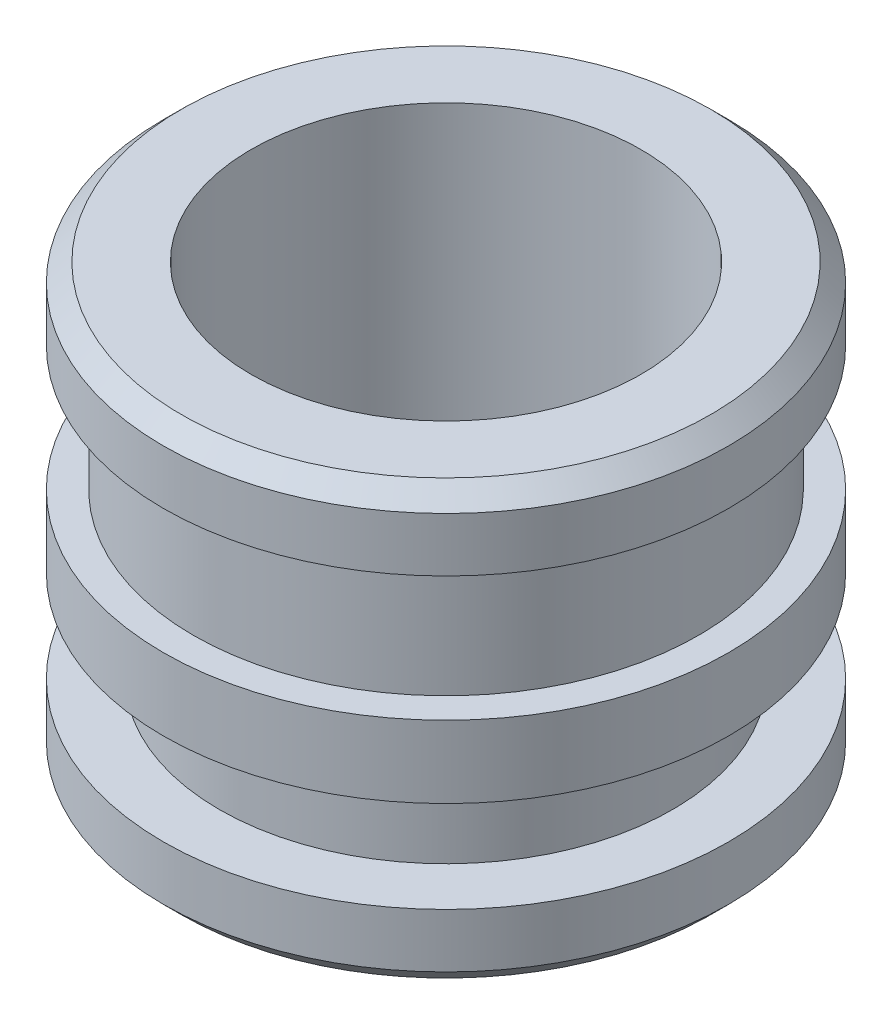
ISO-10303-21;
HEADER;
FILE_DESCRIPTION(('STEP AP214'),'2;1');
FILE_NAME('part.step','',(''),(''),'','','');
FILE_SCHEMA(('AUTOMOTIVE_DESIGN { 1 0 10303 214 1 1 1 1 }'));
ENDSEC;
DATA;
#1=APPLICATION_CONTEXT('core data for automotive mechanical design processes');
#2=APPLICATION_PROTOCOL_DEFINITION('international standard','automotive_design',2000,#1);
#3=PRODUCT_CONTEXT('',#1,'mechanical');
#4=PRODUCT('Part','Part','',(#3));
#5=PRODUCT_RELATED_PRODUCT_CATEGORY('part','',(#4));
#6=PRODUCT_DEFINITION_FORMATION('','',#4);
#7=PRODUCT_DEFINITION_CONTEXT('part definition',#1,'design');
#8=PRODUCT_DEFINITION('design','',#6,#7);
#9=PRODUCT_DEFINITION_SHAPE('','',#8);
#10=(LENGTH_UNIT() NAMED_UNIT(*) SI_UNIT(.MILLI.,.METRE.));
#11=(NAMED_UNIT(*) PLANE_ANGLE_UNIT() SI_UNIT($,.RADIAN.));
#12=(NAMED_UNIT(*) SI_UNIT($,.STERADIAN.) SOLID_ANGLE_UNIT());
#13=UNCERTAINTY_MEASURE_WITH_UNIT(LENGTH_MEASURE(1.E-05),#10,'distance_accuracy_value','');
#14=(GEOMETRIC_REPRESENTATION_CONTEXT(3) GLOBAL_UNCERTAINTY_ASSIGNED_CONTEXT((#13)) GLOBAL_UNIT_ASSIGNED_CONTEXT((#10,
#11,#12)) REPRESENTATION_CONTEXT('',''));
#15=CARTESIAN_POINT('',(0.,0.,0.));
#16=DIRECTION('',(0.,0.,1.));
#17=DIRECTION('',(1.,0.,0.));
#18=AXIS2_PLACEMENT_3D('',#15,#16,#17);
#19=CARTESIAN_POINT('',(0.,0.,0.));
#20=DIRECTION('',(0.,1.,0.));
#21=DIRECTION('',(0.,0.,1.));
#22=AXIS2_PLACEMENT_3D('',#19,#20,#21);
#23=PLANE('',#22);
#24=CARTESIAN_POINT('',(0.,0.,0.));
#25=DIRECTION('',(0.,1.,0.));
#26=DIRECTION('',(0.,0.,1.));
#27=AXIS2_PLACEMENT_3D('',#24,#25,#26);
#28=CIRCLE('',#27,3.665);
#29=CARTESIAN_POINT('',(0.,0.,3.665));
#30=VERTEX_POINT('',#29);
#31=EDGE_CURVE('E10',#30,#30,#28,.F.);
#32=ORIENTED_EDGE('',*,*,#31,.T.);
#33=EDGE_LOOP('',(#32));
#34=FACE_BOUND('',#33,.T.);
#35=ADVANCED_FACE('F30',(#34),#23,.F.);
#36=CARTESIAN_POINT('',(3.915,6.,0.));
#37=DIRECTION('',(0.,-1.,0.));
#38=DIRECTION('',(0.,0.,-1.));
#39=AXIS2_PLACEMENT_3D('',#36,#37,#38);
#40=PLANE('',#39);
#41=CARTESIAN_POINT('',(0.,6.,0.));
#42=DIRECTION('',(0.,1.,0.));
#43=DIRECTION('',(0.,0.,1.));
#44=AXIS2_PLACEMENT_3D('',#41,#42,#43);
#45=CIRCLE('',#44,2.7);
#46=CARTESIAN_POINT('',(0.,6.,2.7));
#47=VERTEX_POINT('',#46);
#48=EDGE_CURVE('E75',#47,#47,#45,.T.);
#49=ORIENTED_EDGE('',*,*,#48,.F.);
#50=EDGE_LOOP('',(#49));
#51=FACE_BOUND('',#50,.T.);
#52=CARTESIAN_POINT('',(0.,6.,0.));
#53=DIRECTION('',(0.,-1.,0.));
#54=DIRECTION('',(0.,0.,-1.));
#55=AXIS2_PLACEMENT_3D('',#52,#53,#54);
#56=CIRCLE('',#55,3.665);
#57=CARTESIAN_POINT('',(0.,6.,-3.665));
#58=VERTEX_POINT('',#57);
#59=EDGE_CURVE('E45',#58,#58,#56,.F.);
#60=ORIENTED_EDGE('',*,*,#59,.T.);
#61=EDGE_LOOP('',(#60));
#62=FACE_BOUND('',#61,.T.);
#63=ADVANCED_FACE('F89',(#51,#62),#40,.F.);
#64=CARTESIAN_POINT('',(0.,11.0481009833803,0.));
#65=DIRECTION('',(0.,1.,0.));
#66=DIRECTION('',(0.,0.,1.));
#67=AXIS2_PLACEMENT_3D('',#64,#65,#66);
#68=CYLINDRICAL_SURFACE('',#67,3.915);
#69=CARTESIAN_POINT('',(0.,5.75,0.));
#70=DIRECTION('',(0.,-1.,0.));
#71=DIRECTION('',(0.,0.,-1.));
#72=AXIS2_PLACEMENT_3D('',#69,#70,#71);
#73=CIRCLE('',#72,3.915);
#74=CARTESIAN_POINT('',(0.,5.75,-3.915));
#75=VERTEX_POINT('',#74);
#76=EDGE_CURVE('E41',#75,#75,#73,.T.);
#77=ORIENTED_EDGE('',*,*,#76,.T.);
#78=EDGE_LOOP('',(#77));
#79=FACE_BOUND('',#78,.T.);
#80=CARTESIAN_POINT('',(0.,5.,0.));
#81=DIRECTION('',(0.,1.,0.));
#82=DIRECTION('',(0.,0.,1.));
#83=AXIS2_PLACEMENT_3D('',#80,#81,#82);
#84=CIRCLE('',#83,3.915);
#85=CARTESIAN_POINT('',(0.,5.,3.915));
#86=VERTEX_POINT('',#85);
#87=EDGE_CURVE('E50',#86,#86,#84,.T.);
#88=ORIENTED_EDGE('',*,*,#87,.T.);
#89=EDGE_LOOP('',(#88));
#90=FACE_BOUND('',#89,.T.);
#91=ADVANCED_FACE('F92',(#79,#90),#68,.T.);
#92=CARTESIAN_POINT('',(3.915,5.,0.));
#93=DIRECTION('',(0.,1.,0.));
#94=DIRECTION('',(0.,0.,1.));
#95=AXIS2_PLACEMENT_3D('',#92,#93,#94);
#96=PLANE('',#95);
#97=ORIENTED_EDGE('',*,*,#87,.F.);
#98=EDGE_LOOP('',(#97));
#99=FACE_BOUND('',#98,.T.);
#100=CARTESIAN_POINT('',(0.,5.,0.));
#101=DIRECTION('',(0.,1.,0.));
#102=DIRECTION('',(0.,0.,1.));
#103=AXIS2_PLACEMENT_3D('',#100,#101,#102);
#104=CIRCLE('',#103,3.5);
#105=CARTESIAN_POINT('',(0.,5.,3.5));
#106=VERTEX_POINT('',#105);
#107=EDGE_CURVE('E53',#106,#106,#104,.T.);
#108=ORIENTED_EDGE('',*,*,#107,.T.);
#109=EDGE_LOOP('',(#108));
#110=FACE_BOUND('',#109,.T.);
#111=ADVANCED_FACE('F115',(#99,#110),#96,.F.);
#112=CARTESIAN_POINT('',(0.,11.0481009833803,0.));
#113=DIRECTION('',(0.,1.,0.));
#114=DIRECTION('',(0.,0.,1.));
#115=AXIS2_PLACEMENT_3D('',#112,#113,#114);
#116=CYLINDRICAL_SURFACE('',#115,3.5);
#117=ORIENTED_EDGE('',*,*,#107,.F.);
#118=EDGE_LOOP('',(#117));
#119=FACE_BOUND('',#118,.T.);
#120=CARTESIAN_POINT('',(0.,3.27,0.));
#121=DIRECTION('',(0.,1.,0.));
#122=DIRECTION('',(0.,0.,1.));
#123=AXIS2_PLACEMENT_3D('',#120,#121,#122);
#124=CIRCLE('',#123,3.5);
#125=CARTESIAN_POINT('',(0.,3.27,3.5));
#126=VERTEX_POINT('',#125);
#127=EDGE_CURVE('E56',#126,#126,#124,.T.);
#128=ORIENTED_EDGE('',*,*,#127,.T.);
#129=EDGE_LOOP('',(#128));
#130=FACE_BOUND('',#129,.T.);
#131=ADVANCED_FACE('F119',(#119,#130),#116,.T.);
#132=CARTESIAN_POINT('',(3.5,3.27,0.));
#133=DIRECTION('',(0.,-1.,0.));
#134=DIRECTION('',(0.,0.,-1.));
#135=AXIS2_PLACEMENT_3D('',#132,#133,#134);
#136=PLANE('',#135);
#137=ORIENTED_EDGE('',*,*,#127,.F.);
#138=EDGE_LOOP('',(#137));
#139=FACE_BOUND('',#138,.T.);
#140=CARTESIAN_POINT('',(0.,3.27,0.));
#141=DIRECTION('',(0.,1.,0.));
#142=DIRECTION('',(0.,0.,1.));
#143=AXIS2_PLACEMENT_3D('',#140,#141,#142);
#144=CIRCLE('',#143,3.91500000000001);
#145=CARTESIAN_POINT('',(0.,3.27,3.91500000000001));
#146=VERTEX_POINT('',#145);
#147=EDGE_CURVE('E59',#146,#146,#144,.T.);
#148=ORIENTED_EDGE('',*,*,#147,.T.);
#149=EDGE_LOOP('',(#148));
#150=FACE_BOUND('',#149,.T.);
#151=ADVANCED_FACE('F123',(#139,#150),#136,.F.);
#152=CARTESIAN_POINT('',(0.,11.0481009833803,0.));
#153=DIRECTION('',(0.,1.,0.));
#154=DIRECTION('',(0.,0.,1.));
#155=AXIS2_PLACEMENT_3D('',#152,#153,#154);
#156=CYLINDRICAL_SURFACE('',#155,3.91500000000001);
#157=ORIENTED_EDGE('',*,*,#147,.F.);
#158=EDGE_LOOP('',(#157));
#159=FACE_BOUND('',#158,.T.);
#160=CARTESIAN_POINT('',(0.,2.27,0.));
#161=DIRECTION('',(0.,1.,0.));
#162=DIRECTION('',(0.,0.,1.));
#163=AXIS2_PLACEMENT_3D('',#160,#161,#162);
#164=CIRCLE('',#163,3.91500000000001);
#165=CARTESIAN_POINT('',(0.,2.27,3.91500000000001));
#166=VERTEX_POINT('',#165);
#167=EDGE_CURVE('E62',#166,#166,#164,.T.);
#168=ORIENTED_EDGE('',*,*,#167,.T.);
#169=EDGE_LOOP('',(#168));
#170=FACE_BOUND('',#169,.T.);
#171=ADVANCED_FACE('F127',(#159,#170),#156,.T.);
#172=CARTESIAN_POINT('',(3.14000000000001,2.27,0.));
#173=DIRECTION('',(0.,1.,0.));
#174=DIRECTION('',(0.,0.,1.));
#175=AXIS2_PLACEMENT_3D('',#172,#173,#174);
#176=PLANE('',#175);
#177=ORIENTED_EDGE('',*,*,#167,.F.);
#178=EDGE_LOOP('',(#177));
#179=FACE_BOUND('',#178,.T.);
#180=CARTESIAN_POINT('',(0.,2.27,0.));
#181=DIRECTION('',(0.,1.,0.));
#182=DIRECTION('',(0.,0.,1.));
#183=AXIS2_PLACEMENT_3D('',#180,#181,#182);
#184=CIRCLE('',#183,3.14000000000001);
#185=CARTESIAN_POINT('',(0.,2.27,3.14000000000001));
#186=VERTEX_POINT('',#185);
#187=EDGE_CURVE('E65',#186,#186,#184,.T.);
#188=ORIENTED_EDGE('',*,*,#187,.T.);
#189=EDGE_LOOP('',(#188));
#190=FACE_BOUND('',#189,.T.);
#191=ADVANCED_FACE('F131',(#179,#190),#176,.F.);
#192=CARTESIAN_POINT('',(0.,11.0481009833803,0.));
#193=DIRECTION('',(0.,1.,0.));
#194=DIRECTION('',(0.,0.,1.));
#195=AXIS2_PLACEMENT_3D('',#192,#193,#194);
#196=CYLINDRICAL_SURFACE('',#195,3.14000000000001);
#197=ORIENTED_EDGE('',*,*,#187,.F.);
#198=EDGE_LOOP('',(#197));
#199=FACE_BOUND('',#198,.T.);
#200=CARTESIAN_POINT('',(0.,1.,0.));
#201=DIRECTION('',(0.,1.,0.));
#202=DIRECTION('',(0.,0.,1.));
#203=AXIS2_PLACEMENT_3D('',#200,#201,#202);
#204=CIRCLE('',#203,3.14000000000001);
#205=CARTESIAN_POINT('',(0.,1.,3.14000000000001));
#206=VERTEX_POINT('',#205);
#207=EDGE_CURVE('E68',#206,#206,#204,.T.);
#208=ORIENTED_EDGE('',*,*,#207,.T.);
#209=EDGE_LOOP('',(#208));
#210=FACE_BOUND('',#209,.T.);
#211=ADVANCED_FACE('F135',(#199,#210),#196,.T.);
#212=CARTESIAN_POINT('',(3.91500000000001,1.,0.));
#213=DIRECTION('',(0.,-1.,0.));
#214=DIRECTION('',(0.,0.,-1.));
#215=AXIS2_PLACEMENT_3D('',#212,#213,#214);
#216=PLANE('',#215);
#217=ORIENTED_EDGE('',*,*,#207,.F.);
#218=EDGE_LOOP('',(#217));
#219=FACE_BOUND('',#218,.T.);
#220=CARTESIAN_POINT('',(0.,1.,0.));
#221=DIRECTION('',(0.,1.,0.));
#222=DIRECTION('',(0.,0.,1.));
#223=AXIS2_PLACEMENT_3D('',#220,#221,#222);
#224=CIRCLE('',#223,3.91500000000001);
#225=CARTESIAN_POINT('',(0.,1.,3.91500000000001));
#226=VERTEX_POINT('',#225);
#227=EDGE_CURVE('E71',#226,#226,#224,.T.);
#228=ORIENTED_EDGE('',*,*,#227,.T.);
#229=EDGE_LOOP('',(#228));
#230=FACE_BOUND('',#229,.T.);
#231=ADVANCED_FACE('F105',(#219,#230),#216,.F.);
#232=CARTESIAN_POINT('',(0.,11.0481009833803,0.));
#233=DIRECTION('',(0.,1.,0.));
#234=DIRECTION('',(0.,0.,1.));
#235=AXIS2_PLACEMENT_3D('',#232,#233,#234);
#236=CYLINDRICAL_SURFACE('',#235,3.91500000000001);
#237=CARTESIAN_POINT('',(0.,0.250000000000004,0.));
#238=DIRECTION('',(0.,1.,0.));
#239=DIRECTION('',(0.,0.,1.));
#240=AXIS2_PLACEMENT_3D('',#237,#238,#239);
#241=CIRCLE('',#240,3.91500000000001);
#242=CARTESIAN_POINT('',(0.,0.250000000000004,3.91500000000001));
#243=VERTEX_POINT('',#242);
#244=EDGE_CURVE('E37',#243,#243,#241,.T.);
#245=ORIENTED_EDGE('',*,*,#244,.T.);
#246=EDGE_LOOP('',(#245));
#247=FACE_BOUND('',#246,.T.);
#248=ORIENTED_EDGE('',*,*,#227,.F.);
#249=EDGE_LOOP('',(#248));
#250=FACE_BOUND('',#249,.T.);
#251=ADVANCED_FACE('F98',(#247,#250),#236,.T.);
#252=CARTESIAN_POINT('',(0.,6.,0.));
#253=DIRECTION('',(0.,-1.,0.));
#254=DIRECTION('',(0.,0.,-1.));
#255=AXIS2_PLACEMENT_3D('',#252,#253,#254);
#256=CONICAL_SURFACE('',#255,3.665,0.78539816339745);
#257=ORIENTED_EDGE('',*,*,#76,.F.);
#258=EDGE_LOOP('',(#257));
#259=FACE_BOUND('',#258,.T.);
#260=ORIENTED_EDGE('',*,*,#59,.F.);
#261=EDGE_LOOP('',(#260));
#262=FACE_BOUND('',#261,.T.);
#263=ADVANCED_FACE('F96',(#259,#262),#256,.T.);
#264=CARTESIAN_POINT('',(0.,0.250000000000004,0.));
#265=DIRECTION('',(0.,1.,0.));
#266=DIRECTION('',(0.,0.,1.));
#267=AXIS2_PLACEMENT_3D('',#264,#265,#266);
#268=CONICAL_SURFACE('',#267,3.91500000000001,0.785398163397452);
#269=ORIENTED_EDGE('',*,*,#31,.F.);
#270=EDGE_LOOP('',(#269));
#271=FACE_BOUND('',#270,.T.);
#272=ORIENTED_EDGE('',*,*,#244,.F.);
#273=EDGE_LOOP('',(#272));
#274=FACE_BOUND('',#273,.T.);
#275=ADVANCED_FACE('F32',(#271,#274),#268,.T.);
#276=CARTESIAN_POINT('',(0.,1.5,0.));
#277=DIRECTION('',(0.,1.,0.));
#278=DIRECTION('',(0.,0.,1.));
#279=AXIS2_PLACEMENT_3D('',#276,#277,#278);
#280=CYLINDRICAL_SURFACE('',#279,2.7);
#281=CARTESIAN_POINT('',(0.,1.5,0.));
#282=DIRECTION('',(0.,1.,0.));
#283=DIRECTION('',(0.,0.,1.));
#284=AXIS2_PLACEMENT_3D('',#281,#282,#283);
#285=CIRCLE('',#284,2.7);
#286=CARTESIAN_POINT('',(0.,1.5,2.7));
#287=VERTEX_POINT('',#286);
#288=EDGE_CURVE('E74',#287,#287,#285,.T.);
#289=ORIENTED_EDGE('',*,*,#288,.F.);
#290=EDGE_LOOP('',(#289));
#291=FACE_BOUND('',#290,.T.);
#292=ORIENTED_EDGE('',*,*,#48,.T.);
#293=EDGE_LOOP('',(#292));
#294=FACE_BOUND('',#293,.T.);
#295=ADVANCED_FACE('F83',(#291,#294),#280,.F.);
#296=CARTESIAN_POINT('',(0.,1.5,0.));
#297=DIRECTION('',(0.,1.,0.));
#298=DIRECTION('',(0.,0.,1.));
#299=AXIS2_PLACEMENT_3D('',#296,#297,#298);
#300=PLANE('',#299);
#301=ORIENTED_EDGE('',*,*,#288,.T.);
#302=EDGE_LOOP('',(#301));
#303=FACE_BOUND('',#302,.T.);
#304=ADVANCED_FACE('F81',(#303),#300,.T.);
#305=CLOSED_SHELL('',(#35,#63,#91,#111,#131,#151,#171,#191,#211,#231,#251,#263,#275,#295,#304));
#306=MANIFOLD_SOLID_BREP('B2',#305);
#307=ADVANCED_BREP_SHAPE_REPRESENTATION('',(#18,#306),#14);
#308=SHAPE_DEFINITION_REPRESENTATION(#9,#307);
ENDSEC;
END-ISO-10303-21;
